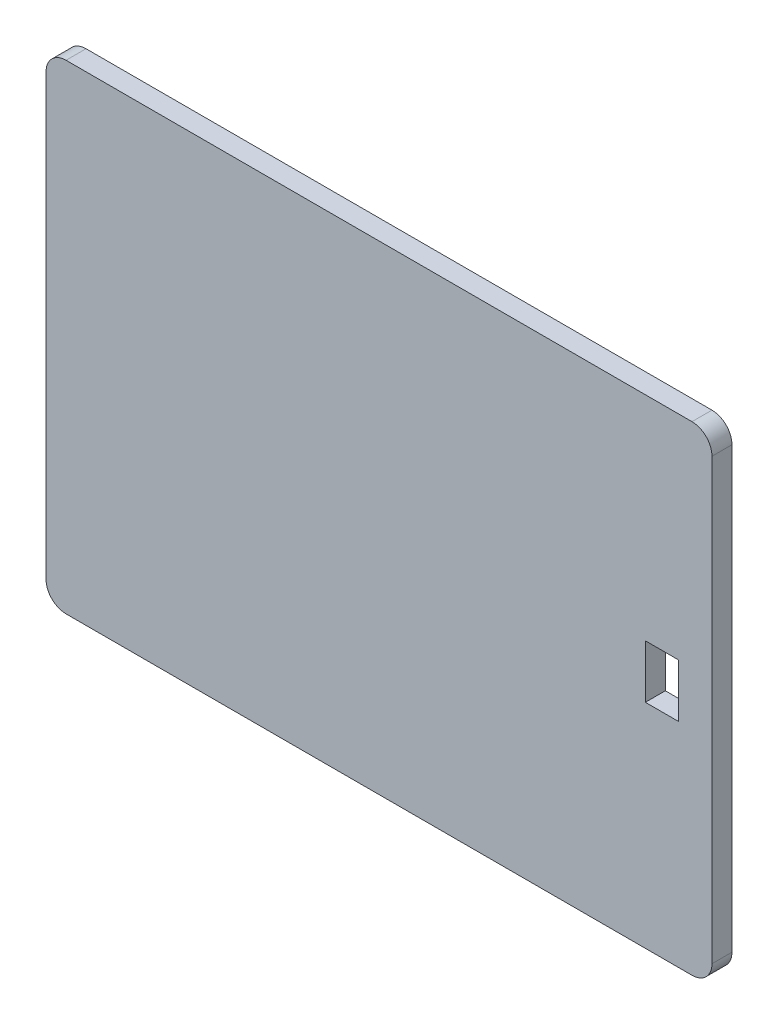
ISO-10303-21;
HEADER;
FILE_DESCRIPTION(('STEP AP214'),'2;1');
FILE_NAME('part.step','',(''),(''),'','','');
FILE_SCHEMA(('AUTOMOTIVE_DESIGN { 1 0 10303 214 1 1 1 1 }'));
ENDSEC;
DATA;
#1=APPLICATION_CONTEXT('core data for automotive mechanical design processes');
#2=APPLICATION_PROTOCOL_DEFINITION('international standard','automotive_design',2000,#1);
#3=PRODUCT_CONTEXT('',#1,'mechanical');
#4=PRODUCT('Part','Part','',(#3));
#5=PRODUCT_RELATED_PRODUCT_CATEGORY('part','',(#4));
#6=PRODUCT_DEFINITION_FORMATION('','',#4);
#7=PRODUCT_DEFINITION_CONTEXT('part definition',#1,'design');
#8=PRODUCT_DEFINITION('design','',#6,#7);
#9=PRODUCT_DEFINITION_SHAPE('','',#8);
#10=(LENGTH_UNIT() NAMED_UNIT(*) SI_UNIT(.MILLI.,.METRE.));
#11=(NAMED_UNIT(*) PLANE_ANGLE_UNIT() SI_UNIT($,.RADIAN.));
#12=(NAMED_UNIT(*) SI_UNIT($,.STERADIAN.) SOLID_ANGLE_UNIT());
#13=UNCERTAINTY_MEASURE_WITH_UNIT(LENGTH_MEASURE(1.E-05),#10,'distance_accuracy_value','');
#14=(GEOMETRIC_REPRESENTATION_CONTEXT(3) GLOBAL_UNCERTAINTY_ASSIGNED_CONTEXT((#13)) GLOBAL_UNIT_ASSIGNED_CONTEXT((#10,
#11,#12)) REPRESENTATION_CONTEXT('',''));
#15=CARTESIAN_POINT('',(0.,0.,0.));
#16=DIRECTION('',(0.,0.,1.));
#17=DIRECTION('',(1.,0.,0.));
#18=AXIS2_PLACEMENT_3D('',#15,#16,#17);
#19=CARTESIAN_POINT('',(3.,69.,3.));
#20=DIRECTION('',(0.,0.,-1.));
#21=DIRECTION('',(-1.,0.,0.));
#22=AXIS2_PLACEMENT_3D('',#19,#20,#21);
#23=CYLINDRICAL_SURFACE('',#22,3.);
#24=CARTESIAN_POINT('',(3.,69.,0.));
#25=DIRECTION('',(0.,0.,1.));
#26=DIRECTION('',(1.,0.,0.));
#27=AXIS2_PLACEMENT_3D('',#24,#25,#26);
#28=CIRCLE('',#27,3.);
#29=CARTESIAN_POINT('',(3.,72.,0.));
#30=VERTEX_POINT('',#29);
#31=CARTESIAN_POINT('',(0.,69.,0.));
#32=VERTEX_POINT('',#31);
#33=EDGE_CURVE('E148',#30,#32,#28,.T.);
#34=ORIENTED_EDGE('',*,*,#33,.T.);
#35=DIRECTION('',(0.,0.,-1.));
#36=VECTOR('',#35,1.);
#37=CARTESIAN_POINT('',(0.,69.,3.));
#38=LINE('',#37,#36);
#39=CARTESIAN_POINT('',(0.,69.,3.));
#40=VERTEX_POINT('',#39);
#41=EDGE_CURVE('E11',#40,#32,#38,.T.);
#42=ORIENTED_EDGE('',*,*,#41,.F.);
#43=CARTESIAN_POINT('',(3.,69.,3.));
#44=DIRECTION('',(0.,0.,1.));
#45=DIRECTION('',(1.,0.,0.));
#46=AXIS2_PLACEMENT_3D('',#43,#44,#45);
#47=CIRCLE('',#46,3.);
#48=CARTESIAN_POINT('',(3.,72.,3.));
#49=VERTEX_POINT('',#48);
#50=EDGE_CURVE('E167',#49,#40,#47,.T.);
#51=ORIENTED_EDGE('',*,*,#50,.F.);
#52=DIRECTION('',(0.,0.,-1.));
#53=VECTOR('',#52,1.);
#54=CARTESIAN_POINT('',(3.,72.,3.));
#55=LINE('',#54,#53);
#56=EDGE_CURVE('E184',#49,#30,#55,.T.);
#57=ORIENTED_EDGE('',*,*,#56,.T.);
#58=EDGE_LOOP('',(#34,#42,#51,#57));
#59=FACE_BOUND('',#58,.T.);
#60=ADVANCED_FACE('F26',(#59),#23,.T.);
#61=CARTESIAN_POINT('',(0.,3.00000000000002,3.));
#62=DIRECTION('',(1.,0.,0.));
#63=DIRECTION('',(0.,0.,-1.));
#64=AXIS2_PLACEMENT_3D('',#61,#62,#63);
#65=PLANE('',#64);
#66=DIRECTION('',(0.,-1.,0.));
#67=VECTOR('',#66,1.);
#68=CARTESIAN_POINT('',(0.,3.00000000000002,0.));
#69=LINE('',#68,#67);
#70=CARTESIAN_POINT('',(0.,3.00000000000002,0.));
#71=VERTEX_POINT('',#70);
#72=EDGE_CURVE('E153',#32,#71,#69,.T.);
#73=ORIENTED_EDGE('',*,*,#72,.T.);
#74=DIRECTION('',(0.,0.,-1.));
#75=VECTOR('',#74,1.);
#76=CARTESIAN_POINT('',(0.,3.00000000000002,3.));
#77=LINE('',#76,#75);
#78=CARTESIAN_POINT('',(0.,3.00000000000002,3.));
#79=VERTEX_POINT('',#78);
#80=EDGE_CURVE('E33',#79,#71,#77,.T.);
#81=ORIENTED_EDGE('',*,*,#80,.F.);
#82=DIRECTION('',(0.,-1.,0.));
#83=VECTOR('',#82,1.);
#84=CARTESIAN_POINT('',(0.,3.00000000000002,3.));
#85=LINE('',#84,#83);
#86=EDGE_CURVE('E170',#40,#79,#85,.T.);
#87=ORIENTED_EDGE('',*,*,#86,.F.);
#88=ORIENTED_EDGE('',*,*,#41,.T.);
#89=EDGE_LOOP('',(#73,#81,#87,#88));
#90=FACE_BOUND('',#89,.T.);
#91=ADVANCED_FACE('F227',(#90),#65,.F.);
#92=CARTESIAN_POINT('',(3.,3.,3.));
#93=DIRECTION('',(0.,0.,-1.));
#94=DIRECTION('',(-1.,0.,0.));
#95=AXIS2_PLACEMENT_3D('',#92,#93,#94);
#96=CYLINDRICAL_SURFACE('',#95,3.);
#97=CARTESIAN_POINT('',(3.,3.,0.));
#98=DIRECTION('',(0.,0.,1.));
#99=DIRECTION('',(1.,0.,0.));
#100=AXIS2_PLACEMENT_3D('',#97,#98,#99);
#101=CIRCLE('',#100,3.);
#102=CARTESIAN_POINT('',(3.00000000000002,0.,0.));
#103=VERTEX_POINT('',#102);
#104=EDGE_CURVE('E155',#71,#103,#101,.T.);
#105=ORIENTED_EDGE('',*,*,#104,.T.);
#106=DIRECTION('',(0.,0.,-1.));
#107=VECTOR('',#106,1.);
#108=CARTESIAN_POINT('',(3.00000000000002,0.,3.));
#109=LINE('',#108,#107);
#110=CARTESIAN_POINT('',(3.00000000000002,0.,3.));
#111=VERTEX_POINT('',#110);
#112=EDGE_CURVE('E199',#111,#103,#109,.T.);
#113=ORIENTED_EDGE('',*,*,#112,.F.);
#114=CARTESIAN_POINT('',(3.,3.,3.));
#115=DIRECTION('',(0.,0.,1.));
#116=DIRECTION('',(1.,0.,0.));
#117=AXIS2_PLACEMENT_3D('',#114,#115,#116);
#118=CIRCLE('',#117,3.);
#119=EDGE_CURVE('E172',#79,#111,#118,.T.);
#120=ORIENTED_EDGE('',*,*,#119,.F.);
#121=ORIENTED_EDGE('',*,*,#80,.T.);
#122=EDGE_LOOP('',(#105,#113,#120,#121));
#123=FACE_BOUND('',#122,.T.);
#124=ADVANCED_FACE('F206',(#123),#96,.T.);
#125=CARTESIAN_POINT('',(3.00000000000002,0.,3.));
#126=DIRECTION('',(0.,1.,0.));
#127=DIRECTION('',(0.,0.,1.));
#128=AXIS2_PLACEMENT_3D('',#125,#126,#127);
#129=PLANE('',#128);
#130=DIRECTION('',(1.,0.,0.));
#131=VECTOR('',#130,1.);
#132=CARTESIAN_POINT('',(3.00000000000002,0.,0.));
#133=LINE('',#132,#131);
#134=CARTESIAN_POINT('',(97.,0.,0.));
#135=VERTEX_POINT('',#134);
#136=EDGE_CURVE('E157',#103,#135,#133,.T.);
#137=ORIENTED_EDGE('',*,*,#136,.T.);
#138=DIRECTION('',(0.,0.,-1.));
#139=VECTOR('',#138,1.);
#140=CARTESIAN_POINT('',(97.,0.,3.));
#141=LINE('',#140,#139);
#142=CARTESIAN_POINT('',(97.,0.,3.));
#143=VERTEX_POINT('',#142);
#144=EDGE_CURVE('E196',#143,#135,#141,.T.);
#145=ORIENTED_EDGE('',*,*,#144,.F.);
#146=DIRECTION('',(1.,0.,0.));
#147=VECTOR('',#146,1.);
#148=CARTESIAN_POINT('',(3.00000000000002,0.,3.));
#149=LINE('',#148,#147);
#150=EDGE_CURVE('E174',#111,#143,#149,.T.);
#151=ORIENTED_EDGE('',*,*,#150,.F.);
#152=ORIENTED_EDGE('',*,*,#112,.T.);
#153=EDGE_LOOP('',(#137,#145,#151,#152));
#154=FACE_BOUND('',#153,.T.);
#155=ADVANCED_FACE('F217',(#154),#129,.F.);
#156=CARTESIAN_POINT('',(97.,3.,3.));
#157=DIRECTION('',(0.,0.,-1.));
#158=DIRECTION('',(-1.,0.,0.));
#159=AXIS2_PLACEMENT_3D('',#156,#157,#158);
#160=CYLINDRICAL_SURFACE('',#159,3.);
#161=CARTESIAN_POINT('',(97.,3.,0.));
#162=DIRECTION('',(0.,0.,1.));
#163=DIRECTION('',(1.,0.,0.));
#164=AXIS2_PLACEMENT_3D('',#161,#162,#163);
#165=CIRCLE('',#164,3.);
#166=CARTESIAN_POINT('',(100.,3.,0.));
#167=VERTEX_POINT('',#166);
#168=EDGE_CURVE('E159',#135,#167,#165,.T.);
#169=ORIENTED_EDGE('',*,*,#168,.T.);
#170=DIRECTION('',(0.,0.,-1.));
#171=VECTOR('',#170,1.);
#172=CARTESIAN_POINT('',(100.,3.,3.));
#173=LINE('',#172,#171);
#174=CARTESIAN_POINT('',(100.,3.,3.));
#175=VERTEX_POINT('',#174);
#176=EDGE_CURVE('E193',#175,#167,#173,.T.);
#177=ORIENTED_EDGE('',*,*,#176,.F.);
#178=CARTESIAN_POINT('',(97.,3.,3.));
#179=DIRECTION('',(0.,0.,1.));
#180=DIRECTION('',(1.,0.,0.));
#181=AXIS2_PLACEMENT_3D('',#178,#179,#180);
#182=CIRCLE('',#181,3.);
#183=EDGE_CURVE('E176',#143,#175,#182,.T.);
#184=ORIENTED_EDGE('',*,*,#183,.F.);
#185=ORIENTED_EDGE('',*,*,#144,.T.);
#186=EDGE_LOOP('',(#169,#177,#184,#185));
#187=FACE_BOUND('',#186,.T.);
#188=ADVANCED_FACE('F221',(#187),#160,.T.);
#189=CARTESIAN_POINT('',(100.,3.,3.));
#190=DIRECTION('',(-1.,0.,0.));
#191=DIRECTION('',(0.,0.,1.));
#192=AXIS2_PLACEMENT_3D('',#189,#190,#191);
#193=PLANE('',#192);
#194=DIRECTION('',(0.,1.,0.));
#195=VECTOR('',#194,1.);
#196=CARTESIAN_POINT('',(100.,3.,0.));
#197=LINE('',#196,#195);
#198=CARTESIAN_POINT('',(100.,69.,0.));
#199=VERTEX_POINT('',#198);
#200=EDGE_CURVE('E161',#167,#199,#197,.T.);
#201=ORIENTED_EDGE('',*,*,#200,.T.);
#202=DIRECTION('',(0.,0.,-1.));
#203=VECTOR('',#202,1.);
#204=CARTESIAN_POINT('',(100.,69.,3.));
#205=LINE('',#204,#203);
#206=CARTESIAN_POINT('',(100.,69.,3.));
#207=VERTEX_POINT('',#206);
#208=EDGE_CURVE('E190',#207,#199,#205,.T.);
#209=ORIENTED_EDGE('',*,*,#208,.F.);
#210=DIRECTION('',(0.,1.,0.));
#211=VECTOR('',#210,1.);
#212=CARTESIAN_POINT('',(100.,3.,3.));
#213=LINE('',#212,#211);
#214=EDGE_CURVE('E178',#175,#207,#213,.T.);
#215=ORIENTED_EDGE('',*,*,#214,.F.);
#216=ORIENTED_EDGE('',*,*,#176,.T.);
#217=EDGE_LOOP('',(#201,#209,#215,#216));
#218=FACE_BOUND('',#217,.T.);
#219=ADVANCED_FACE('F240',(#218),#193,.F.);
#220=CARTESIAN_POINT('',(97.,69.,3.));
#221=DIRECTION('',(0.,0.,-1.));
#222=DIRECTION('',(-1.,0.,0.));
#223=AXIS2_PLACEMENT_3D('',#220,#221,#222);
#224=CYLINDRICAL_SURFACE('',#223,3.);
#225=CARTESIAN_POINT('',(97.,69.,0.));
#226=DIRECTION('',(0.,0.,1.));
#227=DIRECTION('',(1.,0.,0.));
#228=AXIS2_PLACEMENT_3D('',#225,#226,#227);
#229=CIRCLE('',#228,3.);
#230=CARTESIAN_POINT('',(97.,72.,0.));
#231=VERTEX_POINT('',#230);
#232=EDGE_CURVE('E163',#199,#231,#229,.T.);
#233=ORIENTED_EDGE('',*,*,#232,.T.);
#234=DIRECTION('',(0.,0.,-1.));
#235=VECTOR('',#234,1.);
#236=CARTESIAN_POINT('',(97.,72.,3.));
#237=LINE('',#236,#235);
#238=CARTESIAN_POINT('',(97.,72.,3.));
#239=VERTEX_POINT('',#238);
#240=EDGE_CURVE('E187',#239,#231,#237,.T.);
#241=ORIENTED_EDGE('',*,*,#240,.F.);
#242=CARTESIAN_POINT('',(97.,69.,3.));
#243=DIRECTION('',(0.,0.,1.));
#244=DIRECTION('',(1.,0.,0.));
#245=AXIS2_PLACEMENT_3D('',#242,#243,#244);
#246=CIRCLE('',#245,3.);
#247=EDGE_CURVE('E180',#207,#239,#246,.T.);
#248=ORIENTED_EDGE('',*,*,#247,.F.);
#249=ORIENTED_EDGE('',*,*,#208,.T.);
#250=EDGE_LOOP('',(#233,#241,#248,#249));
#251=FACE_BOUND('',#250,.T.);
#252=ADVANCED_FACE('F238',(#251),#224,.T.);
#253=CARTESIAN_POINT('',(3.,72.,3.));
#254=DIRECTION('',(0.,-1.,0.));
#255=DIRECTION('',(0.,0.,-1.));
#256=AXIS2_PLACEMENT_3D('',#253,#254,#255);
#257=PLANE('',#256);
#258=DIRECTION('',(-1.,0.,0.));
#259=VECTOR('',#258,1.);
#260=CARTESIAN_POINT('',(3.,72.,0.));
#261=LINE('',#260,#259);
#262=EDGE_CURVE('E165',#231,#30,#261,.T.);
#263=ORIENTED_EDGE('',*,*,#262,.T.);
#264=ORIENTED_EDGE('',*,*,#56,.F.);
#265=DIRECTION('',(-1.,0.,0.));
#266=VECTOR('',#265,1.);
#267=CARTESIAN_POINT('',(3.,72.,3.));
#268=LINE('',#267,#266);
#269=EDGE_CURVE('E182',#239,#49,#268,.T.);
#270=ORIENTED_EDGE('',*,*,#269,.F.);
#271=ORIENTED_EDGE('',*,*,#240,.T.);
#272=EDGE_LOOP('',(#263,#264,#270,#271));
#273=FACE_BOUND('',#272,.T.);
#274=ADVANCED_FACE('F233',(#273),#257,.F.);
#275=CARTESIAN_POINT('',(3.,69.,3.));
#276=DIRECTION('',(0.,0.,1.));
#277=DIRECTION('',(1.,0.,0.));
#278=AXIS2_PLACEMENT_3D('',#275,#276,#277);
#279=PLANE('',#278);
#280=DIRECTION('',(0.,-1.,0.));
#281=VECTOR('',#280,1.);
#282=CARTESIAN_POINT('',(90.,40.,3.));
#283=LINE('',#282,#281);
#284=CARTESIAN_POINT('',(90.,40.,3.));
#285=VERTEX_POINT('',#284);
#286=CARTESIAN_POINT('',(90.,32.,3.));
#287=VERTEX_POINT('',#286);
#288=EDGE_CURVE('E40',#285,#287,#283,.T.);
#289=ORIENTED_EDGE('',*,*,#288,.F.);
#290=DIRECTION('',(-1.,0.,0.));
#291=VECTOR('',#290,1.);
#292=CARTESIAN_POINT('',(90.,40.,3.));
#293=LINE('',#292,#291);
#294=CARTESIAN_POINT('',(95.,40.,3.));
#295=VERTEX_POINT('',#294);
#296=EDGE_CURVE('E132',#295,#285,#293,.T.);
#297=ORIENTED_EDGE('',*,*,#296,.F.);
#298=DIRECTION('',(0.,1.,0.));
#299=VECTOR('',#298,1.);
#300=CARTESIAN_POINT('',(95.,40.,3.));
#301=LINE('',#300,#299);
#302=CARTESIAN_POINT('',(95.,32.,3.));
#303=VERTEX_POINT('',#302);
#304=EDGE_CURVE('E116',#303,#295,#301,.T.);
#305=ORIENTED_EDGE('',*,*,#304,.F.);
#306=DIRECTION('',(1.,0.,0.));
#307=VECTOR('',#306,1.);
#308=CARTESIAN_POINT('',(90.,32.,3.));
#309=LINE('',#308,#307);
#310=EDGE_CURVE('E125',#287,#303,#309,.T.);
#311=ORIENTED_EDGE('',*,*,#310,.F.);
#312=EDGE_LOOP('',(#289,#297,#305,#311));
#313=FACE_BOUND('',#312,.T.);
#314=ORIENTED_EDGE('',*,*,#50,.T.);
#315=ORIENTED_EDGE('',*,*,#86,.T.);
#316=ORIENTED_EDGE('',*,*,#119,.T.);
#317=ORIENTED_EDGE('',*,*,#150,.T.);
#318=ORIENTED_EDGE('',*,*,#183,.T.);
#319=ORIENTED_EDGE('',*,*,#214,.T.);
#320=ORIENTED_EDGE('',*,*,#247,.T.);
#321=ORIENTED_EDGE('',*,*,#269,.T.);
#322=EDGE_LOOP('',(#314,#315,#316,#317,#318,#319,#320,#321));
#323=FACE_BOUND('',#322,.T.);
#324=ADVANCED_FACE('F129',(#313,#323),#279,.T.);
#325=CARTESIAN_POINT('',(3.,69.,0.));
#326=DIRECTION('',(0.,0.,1.));
#327=DIRECTION('',(1.,0.,0.));
#328=AXIS2_PLACEMENT_3D('',#325,#326,#327);
#329=PLANE('',#328);
#330=DIRECTION('',(-1.,0.,0.));
#331=VECTOR('',#330,1.);
#332=CARTESIAN_POINT('',(90.,40.,0.));
#333=LINE('',#332,#331);
#334=CARTESIAN_POINT('',(95.,40.,0.));
#335=VERTEX_POINT('',#334);
#336=CARTESIAN_POINT('',(90.,40.,0.));
#337=VERTEX_POINT('',#336);
#338=EDGE_CURVE('E143',#335,#337,#333,.T.);
#339=ORIENTED_EDGE('',*,*,#338,.T.);
#340=DIRECTION('',(0.,-1.,0.));
#341=VECTOR('',#340,1.);
#342=CARTESIAN_POINT('',(90.,40.,0.));
#343=LINE('',#342,#341);
#344=CARTESIAN_POINT('',(90.,32.,0.));
#345=VERTEX_POINT('',#344);
#346=EDGE_CURVE('E134',#337,#345,#343,.T.);
#347=ORIENTED_EDGE('',*,*,#346,.T.);
#348=DIRECTION('',(1.,0.,0.));
#349=VECTOR('',#348,1.);
#350=CARTESIAN_POINT('',(90.,32.,0.));
#351=LINE('',#350,#349);
#352=CARTESIAN_POINT('',(95.,32.,0.));
#353=VERTEX_POINT('',#352);
#354=EDGE_CURVE('E140',#345,#353,#351,.T.);
#355=ORIENTED_EDGE('',*,*,#354,.T.);
#356=DIRECTION('',(0.,1.,0.));
#357=VECTOR('',#356,1.);
#358=CARTESIAN_POINT('',(95.,40.,0.));
#359=LINE('',#358,#357);
#360=EDGE_CURVE('E48',#353,#335,#359,.T.);
#361=ORIENTED_EDGE('',*,*,#360,.T.);
#362=EDGE_LOOP('',(#339,#347,#355,#361));
#363=FACE_BOUND('',#362,.T.);
#364=ORIENTED_EDGE('',*,*,#33,.F.);
#365=ORIENTED_EDGE('',*,*,#262,.F.);
#366=ORIENTED_EDGE('',*,*,#232,.F.);
#367=ORIENTED_EDGE('',*,*,#200,.F.);
#368=ORIENTED_EDGE('',*,*,#168,.F.);
#369=ORIENTED_EDGE('',*,*,#136,.F.);
#370=ORIENTED_EDGE('',*,*,#104,.F.);
#371=ORIENTED_EDGE('',*,*,#72,.F.);
#372=EDGE_LOOP('',(#364,#365,#366,#367,#368,#369,#370,#371));
#373=FACE_BOUND('',#372,.T.);
#374=ADVANCED_FACE('F212',(#363,#373),#329,.F.);
#375=CARTESIAN_POINT('',(90.,40.,0.));
#376=DIRECTION('',(-1.,0.,0.));
#377=DIRECTION('',(0.,0.,1.));
#378=AXIS2_PLACEMENT_3D('',#375,#376,#377);
#379=PLANE('',#378);
#380=ORIENTED_EDGE('',*,*,#288,.T.);
#381=DIRECTION('',(0.,0.,1.));
#382=VECTOR('',#381,1.);
#383=CARTESIAN_POINT('',(90.,32.,0.));
#384=LINE('',#383,#382);
#385=EDGE_CURVE('E122',#345,#287,#384,.T.);
#386=ORIENTED_EDGE('',*,*,#385,.F.);
#387=ORIENTED_EDGE('',*,*,#346,.F.);
#388=DIRECTION('',(0.,0.,1.));
#389=VECTOR('',#388,1.);
#390=CARTESIAN_POINT('',(90.,40.,0.));
#391=LINE('',#390,#389);
#392=EDGE_CURVE('E146',#337,#285,#391,.T.);
#393=ORIENTED_EDGE('',*,*,#392,.T.);
#394=EDGE_LOOP('',(#380,#386,#387,#393));
#395=FACE_BOUND('',#394,.T.);
#396=ADVANCED_FACE('F292',(#395),#379,.F.);
#397=CARTESIAN_POINT('',(90.,40.,0.));
#398=DIRECTION('',(0.,1.,0.));
#399=DIRECTION('',(0.,0.,1.));
#400=AXIS2_PLACEMENT_3D('',#397,#398,#399);
#401=PLANE('',#400);
#402=ORIENTED_EDGE('',*,*,#296,.T.);
#403=ORIENTED_EDGE('',*,*,#392,.F.);
#404=ORIENTED_EDGE('',*,*,#338,.F.);
#405=DIRECTION('',(0.,0.,1.));
#406=VECTOR('',#405,1.);
#407=CARTESIAN_POINT('',(95.,40.,0.));
#408=LINE('',#407,#406);
#409=EDGE_CURVE('E121',#335,#295,#408,.T.);
#410=ORIENTED_EDGE('',*,*,#409,.T.);
#411=EDGE_LOOP('',(#402,#403,#404,#410));
#412=FACE_BOUND('',#411,.T.);
#413=ADVANCED_FACE('F300',(#412),#401,.F.);
#414=CARTESIAN_POINT('',(95.,40.,0.));
#415=DIRECTION('',(1.,0.,0.));
#416=DIRECTION('',(0.,0.,-1.));
#417=AXIS2_PLACEMENT_3D('',#414,#415,#416);
#418=PLANE('',#417);
#419=ORIENTED_EDGE('',*,*,#304,.T.);
#420=ORIENTED_EDGE('',*,*,#409,.F.);
#421=ORIENTED_EDGE('',*,*,#360,.F.);
#422=DIRECTION('',(0.,0.,1.));
#423=VECTOR('',#422,1.);
#424=CARTESIAN_POINT('',(95.,32.,0.));
#425=LINE('',#424,#423);
#426=EDGE_CURVE('E112',#353,#303,#425,.T.);
#427=ORIENTED_EDGE('',*,*,#426,.T.);
#428=EDGE_LOOP('',(#419,#420,#421,#427));
#429=FACE_BOUND('',#428,.T.);
#430=ADVANCED_FACE('F114',(#429),#418,.F.);
#431=CARTESIAN_POINT('',(90.,32.,0.));
#432=DIRECTION('',(0.,-1.,0.));
#433=DIRECTION('',(0.,0.,-1.));
#434=AXIS2_PLACEMENT_3D('',#431,#432,#433);
#435=PLANE('',#434);
#436=ORIENTED_EDGE('',*,*,#310,.T.);
#437=ORIENTED_EDGE('',*,*,#426,.F.);
#438=ORIENTED_EDGE('',*,*,#354,.F.);
#439=ORIENTED_EDGE('',*,*,#385,.T.);
#440=EDGE_LOOP('',(#436,#437,#438,#439));
#441=FACE_BOUND('',#440,.T.);
#442=ADVANCED_FACE('F126',(#441),#435,.F.);
#443=CLOSED_SHELL('',(#60,#91,#124,#155,#188,#219,#252,#274,#324,#374,#396,#413,#430,#442));
#444=MANIFOLD_SOLID_BREP('B2',#443);
#445=ADVANCED_BREP_SHAPE_REPRESENTATION('',(#18,#444),#14);
#446=SHAPE_DEFINITION_REPRESENTATION(#9,#445);
ENDSEC;
END-ISO-10303-21;
